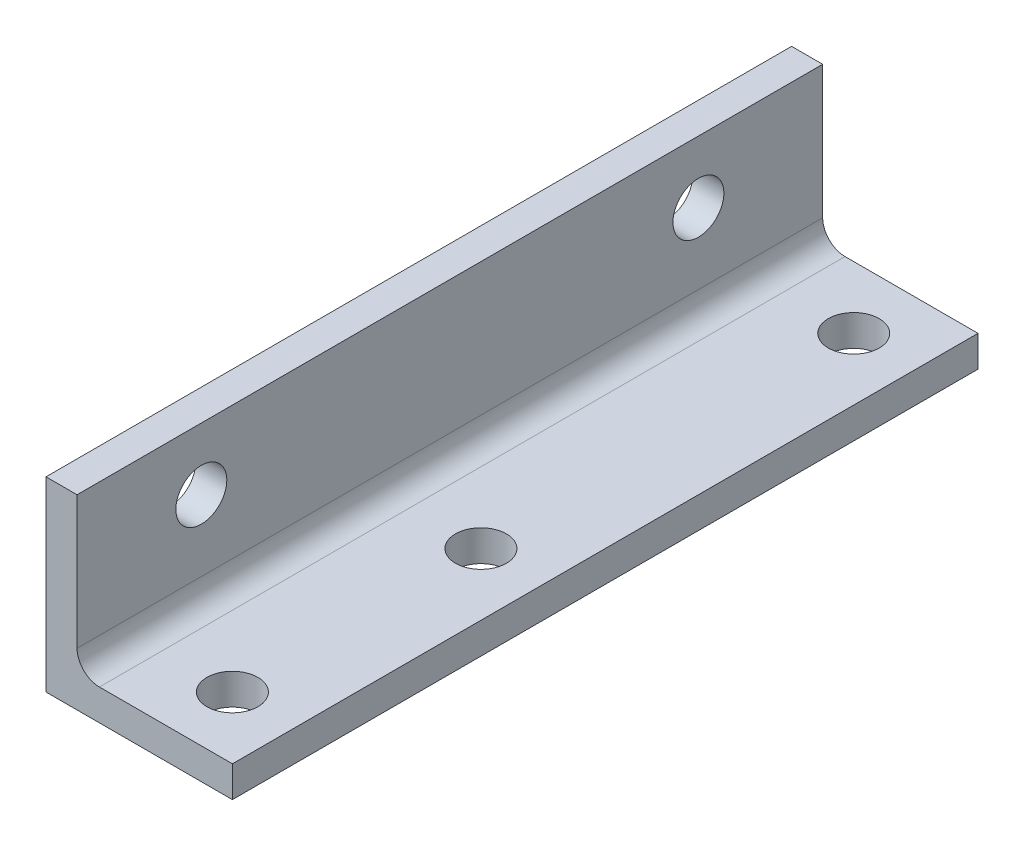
ISO-10303-21;
HEADER;
FILE_DESCRIPTION(('STEP AP214'),'2;1');
FILE_NAME('part.step','',(''),(''),'','','');
FILE_SCHEMA(('AUTOMOTIVE_DESIGN { 1 0 10303 214 1 1 1 1 }'));
ENDSEC;
DATA;
#1=APPLICATION_CONTEXT('core data for automotive mechanical design processes');
#2=APPLICATION_PROTOCOL_DEFINITION('international standard','automotive_design',2000,#1);
#3=PRODUCT_CONTEXT('',#1,'mechanical');
#4=PRODUCT('Part','Part','',(#3));
#5=PRODUCT_RELATED_PRODUCT_CATEGORY('part','',(#4));
#6=PRODUCT_DEFINITION_FORMATION('','',#4);
#7=PRODUCT_DEFINITION_CONTEXT('part definition',#1,'design');
#8=PRODUCT_DEFINITION('design','',#6,#7);
#9=PRODUCT_DEFINITION_SHAPE('','',#8);
#10=(LENGTH_UNIT() NAMED_UNIT(*) SI_UNIT(.MILLI.,.METRE.));
#11=(NAMED_UNIT(*) PLANE_ANGLE_UNIT() SI_UNIT($,.RADIAN.));
#12=(NAMED_UNIT(*) SI_UNIT($,.STERADIAN.) SOLID_ANGLE_UNIT());
#13=UNCERTAINTY_MEASURE_WITH_UNIT(LENGTH_MEASURE(1.E-05),#10,'distance_accuracy_value','');
#14=(GEOMETRIC_REPRESENTATION_CONTEXT(3) GLOBAL_UNCERTAINTY_ASSIGNED_CONTEXT((#13)) GLOBAL_UNIT_ASSIGNED_CONTEXT((#10,
#11,#12)) REPRESENTATION_CONTEXT('',''));
#15=CARTESIAN_POINT('',(0.,0.,0.));
#16=DIRECTION('',(0.,0.,1.));
#17=DIRECTION('',(1.,0.,0.));
#18=AXIS2_PLACEMENT_3D('',#15,#16,#17);
#19=CARTESIAN_POINT('',(0.,0.,152.4));
#20=DIRECTION('',(0.,1.,0.));
#21=DIRECTION('',(0.,0.,1.));
#22=AXIS2_PLACEMENT_3D('',#19,#20,#21);
#23=PLANE('',#22);
#24=CARTESIAN_POINT('',(25.4,0.,12.7));
#25=DIRECTION('',(0.,-1.,0.));
#26=DIRECTION('',(0.,0.,-1.));
#27=AXIS2_PLACEMENT_3D('',#24,#25,#26);
#28=CIRCLE('',#27,5.207);
#29=CARTESIAN_POINT('',(25.4,0.,7.493));
#30=VERTEX_POINT('',#29);
#31=EDGE_CURVE('E158',#30,#30,#28,.T.);
#32=ORIENTED_EDGE('',*,*,#31,.F.);
#33=EDGE_LOOP('',(#32));
#34=FACE_BOUND('',#33,.T.);
#35=CARTESIAN_POINT('',(25.4,0.,139.7));
#36=DIRECTION('',(0.,-1.,0.));
#37=DIRECTION('',(0.,0.,-1.));
#38=AXIS2_PLACEMENT_3D('',#35,#36,#37);
#39=CIRCLE('',#38,5.207);
#40=CARTESIAN_POINT('',(25.4,0.,134.493));
#41=VERTEX_POINT('',#40);
#42=EDGE_CURVE('E149',#41,#41,#39,.T.);
#43=ORIENTED_EDGE('',*,*,#42,.F.);
#44=EDGE_LOOP('',(#43));
#45=FACE_BOUND('',#44,.T.);
#46=CARTESIAN_POINT('',(25.4,0.,88.9));
#47=DIRECTION('',(0.,-1.,0.));
#48=DIRECTION('',(0.,0.,-1.));
#49=AXIS2_PLACEMENT_3D('',#46,#47,#48);
#50=CIRCLE('',#49,5.207);
#51=CARTESIAN_POINT('',(25.4,0.,83.693));
#52=VERTEX_POINT('',#51);
#53=EDGE_CURVE('E146',#52,#52,#50,.T.);
#54=ORIENTED_EDGE('',*,*,#53,.F.);
#55=EDGE_LOOP('',(#54));
#56=FACE_BOUND('',#55,.T.);
#57=DIRECTION('',(1.,0.,0.));
#58=VECTOR('',#57,1.);
#59=CARTESIAN_POINT('',(0.,0.,0.));
#60=LINE('',#59,#58);
#61=CARTESIAN_POINT('',(0.,0.,0.));
#62=VERTEX_POINT('',#61);
#63=CARTESIAN_POINT('',(38.1,0.,0.));
#64=VERTEX_POINT('',#63);
#65=EDGE_CURVE('E102',#62,#64,#60,.T.);
#66=ORIENTED_EDGE('',*,*,#65,.T.);
#67=DIRECTION('',(0.,0.,-1.));
#68=VECTOR('',#67,1.);
#69=CARTESIAN_POINT('',(38.1,0.,152.4));
#70=LINE('',#69,#68);
#71=CARTESIAN_POINT('',(38.1,0.,152.4));
#72=VERTEX_POINT('',#71);
#73=EDGE_CURVE('E87',#72,#64,#70,.T.);
#74=ORIENTED_EDGE('',*,*,#73,.F.);
#75=DIRECTION('',(1.,0.,0.));
#76=VECTOR('',#75,1.);
#77=CARTESIAN_POINT('',(0.,0.,152.4));
#78=LINE('',#77,#76);
#79=CARTESIAN_POINT('',(0.,0.,152.4));
#80=VERTEX_POINT('',#79);
#81=EDGE_CURVE('E122',#80,#72,#78,.T.);
#82=ORIENTED_EDGE('',*,*,#81,.F.);
#83=DIRECTION('',(0.,0.,-1.));
#84=VECTOR('',#83,1.);
#85=CARTESIAN_POINT('',(0.,0.,152.4));
#86=LINE('',#85,#84);
#87=EDGE_CURVE('E104',#80,#62,#86,.T.);
#88=ORIENTED_EDGE('',*,*,#87,.T.);
#89=EDGE_LOOP('',(#66,#74,#82,#88));
#90=FACE_BOUND('',#89,.T.);
#91=ADVANCED_FACE('F28',(#34,#45,#56,#90),#23,.F.);
#92=CARTESIAN_POINT('',(38.1,6.35,152.4));
#93=DIRECTION('',(1.,0.,0.));
#94=DIRECTION('',(0.,0.,-1.));
#95=AXIS2_PLACEMENT_3D('',#92,#93,#94);
#96=PLANE('',#95);
#97=DIRECTION('',(0.,-1.,0.));
#98=VECTOR('',#97,1.);
#99=CARTESIAN_POINT('',(38.1,6.35,0.));
#100=LINE('',#99,#98);
#101=CARTESIAN_POINT('',(38.1,6.35,0.));
#102=VERTEX_POINT('',#101);
#103=EDGE_CURVE('E92',#102,#64,#100,.T.);
#104=ORIENTED_EDGE('',*,*,#103,.F.);
#105=DIRECTION('',(0.,0.,-1.));
#106=VECTOR('',#105,1.);
#107=CARTESIAN_POINT('',(38.1,6.35,152.4));
#108=LINE('',#107,#106);
#109=CARTESIAN_POINT('',(38.1,6.35,152.4));
#110=VERTEX_POINT('',#109);
#111=EDGE_CURVE('E98',#110,#102,#108,.T.);
#112=ORIENTED_EDGE('',*,*,#111,.F.);
#113=DIRECTION('',(0.,-1.,0.));
#114=VECTOR('',#113,1.);
#115=CARTESIAN_POINT('',(38.1,6.35,152.4));
#116=LINE('',#115,#114);
#117=EDGE_CURVE('E94',#110,#72,#116,.T.);
#118=ORIENTED_EDGE('',*,*,#117,.T.);
#119=ORIENTED_EDGE('',*,*,#73,.T.);
#120=EDGE_LOOP('',(#104,#112,#118,#119));
#121=FACE_BOUND('',#120,.T.);
#122=ADVANCED_FACE('F89',(#121),#96,.T.);
#123=CARTESIAN_POINT('',(0.,6.35,152.4));
#124=DIRECTION('',(0.,1.,0.));
#125=DIRECTION('',(0.,0.,1.));
#126=AXIS2_PLACEMENT_3D('',#123,#124,#125);
#127=PLANE('',#126);
#128=CARTESIAN_POINT('',(25.4,6.35000000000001,12.7));
#129=DIRECTION('',(0.,1.,0.));
#130=DIRECTION('',(0.,0.,1.));
#131=AXIS2_PLACEMENT_3D('',#128,#129,#130);
#132=CIRCLE('',#131,5.207);
#133=CARTESIAN_POINT('',(25.4,6.35000000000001,7.493));
#134=VERTEX_POINT('',#133);
#135=EDGE_CURVE('E31',#134,#134,#132,.T.);
#136=ORIENTED_EDGE('',*,*,#135,.F.);
#137=EDGE_LOOP('',(#136));
#138=FACE_BOUND('',#137,.T.);
#139=CARTESIAN_POINT('',(25.4,6.35000000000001,139.7));
#140=DIRECTION('',(0.,1.,0.));
#141=DIRECTION('',(0.,0.,1.));
#142=AXIS2_PLACEMENT_3D('',#139,#140,#141);
#143=CIRCLE('',#142,5.207);
#144=CARTESIAN_POINT('',(25.4,6.35000000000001,134.493));
#145=VERTEX_POINT('',#144);
#146=EDGE_CURVE('E147',#145,#145,#143,.T.);
#147=ORIENTED_EDGE('',*,*,#146,.F.);
#148=EDGE_LOOP('',(#147));
#149=FACE_BOUND('',#148,.T.);
#150=CARTESIAN_POINT('',(25.4,6.35000000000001,88.9));
#151=DIRECTION('',(0.,1.,0.));
#152=DIRECTION('',(0.,0.,1.));
#153=AXIS2_PLACEMENT_3D('',#150,#151,#152);
#154=CIRCLE('',#153,5.207);
#155=CARTESIAN_POINT('',(25.4,6.35000000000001,83.693));
#156=VERTEX_POINT('',#155);
#157=EDGE_CURVE('E106',#156,#156,#154,.T.);
#158=ORIENTED_EDGE('',*,*,#157,.F.);
#159=EDGE_LOOP('',(#158));
#160=FACE_BOUND('',#159,.T.);
#161=DIRECTION('',(1.,0.,0.));
#162=VECTOR('',#161,1.);
#163=CARTESIAN_POINT('',(0.,6.35,0.));
#164=LINE('',#163,#162);
#165=CARTESIAN_POINT('',(10.922,6.35,0.));
#166=VERTEX_POINT('',#165);
#167=EDGE_CURVE('E109',#166,#102,#164,.T.);
#168=ORIENTED_EDGE('',*,*,#167,.F.);
#169=DIRECTION('',(0.,0.,-1.));
#170=VECTOR('',#169,1.);
#171=CARTESIAN_POINT('',(10.922,6.35,152.4));
#172=LINE('',#171,#170);
#173=CARTESIAN_POINT('',(10.922,6.35,152.4));
#174=VERTEX_POINT('',#173);
#175=EDGE_CURVE('E44',#166,#174,#172,.F.);
#176=ORIENTED_EDGE('',*,*,#175,.T.);
#177=DIRECTION('',(1.,0.,0.));
#178=VECTOR('',#177,1.);
#179=CARTESIAN_POINT('',(0.,6.35,152.4));
#180=LINE('',#179,#178);
#181=EDGE_CURVE('E125',#174,#110,#180,.T.);
#182=ORIENTED_EDGE('',*,*,#181,.T.);
#183=ORIENTED_EDGE('',*,*,#111,.T.);
#184=EDGE_LOOP('',(#168,#176,#182,#183));
#185=FACE_BOUND('',#184,.T.);
#186=ADVANCED_FACE('F198',(#138,#149,#160,#185),#127,.T.);
#187=CARTESIAN_POINT('',(6.35,38.1,152.4));
#188=DIRECTION('',(1.,0.,0.));
#189=DIRECTION('',(0.,1.,0.));
#190=AXIS2_PLACEMENT_3D('',#187,#188,#189);
#191=PLANE('',#190);
#192=CARTESIAN_POINT('',(6.35000000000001,25.4,25.4));
#193=DIRECTION('',(1.,0.,0.));
#194=DIRECTION('',(0.,1.,0.));
#195=AXIS2_PLACEMENT_3D('',#192,#193,#194);
#196=CIRCLE('',#195,5.207);
#197=CARTESIAN_POINT('',(6.35000000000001,20.193,25.4));
#198=VERTEX_POINT('',#197);
#199=EDGE_CURVE('E168',#198,#198,#196,.T.);
#200=ORIENTED_EDGE('',*,*,#199,.F.);
#201=EDGE_LOOP('',(#200));
#202=FACE_BOUND('',#201,.T.);
#203=CARTESIAN_POINT('',(6.35000000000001,25.4,127.));
#204=DIRECTION('',(1.,0.,0.));
#205=DIRECTION('',(0.,1.,0.));
#206=AXIS2_PLACEMENT_3D('',#203,#204,#205);
#207=CIRCLE('',#206,5.20699999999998);
#208=CARTESIAN_POINT('',(6.35000000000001,20.193,127.));
#209=VERTEX_POINT('',#208);
#210=EDGE_CURVE('E162',#209,#209,#207,.T.);
#211=ORIENTED_EDGE('',*,*,#210,.F.);
#212=EDGE_LOOP('',(#211));
#213=FACE_BOUND('',#212,.T.);
#214=DIRECTION('',(0.,-1.,0.));
#215=VECTOR('',#214,1.);
#216=CARTESIAN_POINT('',(6.35,38.1,152.4));
#217=LINE('',#216,#215);
#218=CARTESIAN_POINT('',(6.35,38.1,152.4));
#219=VERTEX_POINT('',#218);
#220=CARTESIAN_POINT('',(6.35,10.922,152.4));
#221=VERTEX_POINT('',#220);
#222=EDGE_CURVE('E127',#219,#221,#217,.T.);
#223=ORIENTED_EDGE('',*,*,#222,.T.);
#224=DIRECTION('',(0.,0.,-1.));
#225=VECTOR('',#224,1.);
#226=CARTESIAN_POINT('',(6.35,10.922,0.));
#227=LINE('',#226,#225);
#228=CARTESIAN_POINT('',(6.35,10.922,0.));
#229=VERTEX_POINT('',#228);
#230=EDGE_CURVE('E97',#221,#229,#227,.T.);
#231=ORIENTED_EDGE('',*,*,#230,.T.);
#232=DIRECTION('',(0.,-1.,0.));
#233=VECTOR('',#232,1.);
#234=CARTESIAN_POINT('',(6.35,38.1,0.));
#235=LINE('',#234,#233);
#236=CARTESIAN_POINT('',(6.35,38.1,0.));
#237=VERTEX_POINT('',#236);
#238=EDGE_CURVE('E112',#237,#229,#235,.T.);
#239=ORIENTED_EDGE('',*,*,#238,.F.);
#240=DIRECTION('',(0.,0.,-1.));
#241=VECTOR('',#240,1.);
#242=CARTESIAN_POINT('',(6.35,38.1,152.4));
#243=LINE('',#242,#241);
#244=EDGE_CURVE('E138',#219,#237,#243,.T.);
#245=ORIENTED_EDGE('',*,*,#244,.F.);
#246=EDGE_LOOP('',(#223,#231,#239,#245));
#247=FACE_BOUND('',#246,.T.);
#248=ADVANCED_FACE('F192',(#202,#213,#247),#191,.T.);
#249=CARTESIAN_POINT('',(0.,38.1,152.4));
#250=DIRECTION('',(0.,1.,0.));
#251=DIRECTION('',(0.,0.,1.));
#252=AXIS2_PLACEMENT_3D('',#249,#250,#251);
#253=PLANE('',#252);
#254=DIRECTION('',(1.,0.,0.));
#255=VECTOR('',#254,1.);
#256=CARTESIAN_POINT('',(0.,38.1,0.));
#257=LINE('',#256,#255);
#258=CARTESIAN_POINT('',(0.,38.1,0.));
#259=VERTEX_POINT('',#258);
#260=EDGE_CURVE('E117',#259,#237,#257,.T.);
#261=ORIENTED_EDGE('',*,*,#260,.F.);
#262=DIRECTION('',(0.,0.,-1.));
#263=VECTOR('',#262,1.);
#264=CARTESIAN_POINT('',(0.,38.1,152.4));
#265=LINE('',#264,#263);
#266=CARTESIAN_POINT('',(0.,38.1,152.4));
#267=VERTEX_POINT('',#266);
#268=EDGE_CURVE('E136',#267,#259,#265,.T.);
#269=ORIENTED_EDGE('',*,*,#268,.F.);
#270=DIRECTION('',(1.,0.,0.));
#271=VECTOR('',#270,1.);
#272=CARTESIAN_POINT('',(0.,38.1,152.4));
#273=LINE('',#272,#271);
#274=EDGE_CURVE('E130',#267,#219,#273,.T.);
#275=ORIENTED_EDGE('',*,*,#274,.T.);
#276=ORIENTED_EDGE('',*,*,#244,.T.);
#277=EDGE_LOOP('',(#261,#269,#275,#276));
#278=FACE_BOUND('',#277,.T.);
#279=ADVANCED_FACE('F181',(#278),#253,.T.);
#280=CARTESIAN_POINT('',(0.,38.1,152.4));
#281=DIRECTION('',(1.,0.,0.));
#282=DIRECTION('',(0.,1.,0.));
#283=AXIS2_PLACEMENT_3D('',#280,#281,#282);
#284=PLANE('',#283);
#285=CARTESIAN_POINT('',(0.,25.4,25.4));
#286=DIRECTION('',(-1.,0.,0.));
#287=DIRECTION('',(0.,-1.,0.));
#288=AXIS2_PLACEMENT_3D('',#285,#286,#287);
#289=CIRCLE('',#288,5.207);
#290=CARTESIAN_POINT('',(0.,20.193,25.4));
#291=VERTEX_POINT('',#290);
#292=EDGE_CURVE('E171',#291,#291,#289,.T.);
#293=ORIENTED_EDGE('',*,*,#292,.F.);
#294=EDGE_LOOP('',(#293));
#295=FACE_BOUND('',#294,.T.);
#296=CARTESIAN_POINT('',(0.,25.4,127.));
#297=DIRECTION('',(-1.,0.,0.));
#298=DIRECTION('',(0.,-1.,0.));
#299=AXIS2_PLACEMENT_3D('',#296,#297,#298);
#300=CIRCLE('',#299,5.20699999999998);
#301=CARTESIAN_POINT('',(0.,20.193,127.));
#302=VERTEX_POINT('',#301);
#303=EDGE_CURVE('E165',#302,#302,#300,.T.);
#304=ORIENTED_EDGE('',*,*,#303,.F.);
#305=EDGE_LOOP('',(#304));
#306=FACE_BOUND('',#305,.T.);
#307=DIRECTION('',(0.,-1.,0.));
#308=VECTOR('',#307,1.);
#309=CARTESIAN_POINT('',(0.,38.1,0.));
#310=LINE('',#309,#308);
#311=EDGE_CURVE('E120',#259,#62,#310,.T.);
#312=ORIENTED_EDGE('',*,*,#311,.T.);
#313=ORIENTED_EDGE('',*,*,#87,.F.);
#314=DIRECTION('',(0.,-1.,0.));
#315=VECTOR('',#314,1.);
#316=CARTESIAN_POINT('',(0.,38.1,152.4));
#317=LINE('',#316,#315);
#318=EDGE_CURVE('E133',#267,#80,#317,.T.);
#319=ORIENTED_EDGE('',*,*,#318,.F.);
#320=ORIENTED_EDGE('',*,*,#268,.T.);
#321=EDGE_LOOP('',(#312,#313,#319,#320));
#322=FACE_BOUND('',#321,.T.);
#323=ADVANCED_FACE('F177',(#295,#306,#322),#284,.F.);
#324=CARTESIAN_POINT('',(38.1,0.,152.4));
#325=DIRECTION('',(0.,0.,-1.));
#326=DIRECTION('',(-1.,0.,0.));
#327=AXIS2_PLACEMENT_3D('',#324,#325,#326);
#328=PLANE('',#327);
#329=ORIENTED_EDGE('',*,*,#81,.T.);
#330=ORIENTED_EDGE('',*,*,#117,.F.);
#331=ORIENTED_EDGE('',*,*,#181,.F.);
#332=CARTESIAN_POINT('',(10.922,10.922,152.4));
#333=DIRECTION('',(0.,0.,-1.));
#334=DIRECTION('',(-1.,0.,0.));
#335=AXIS2_PLACEMENT_3D('',#332,#333,#334);
#336=CIRCLE('',#335,4.572);
#337=EDGE_CURVE('E11',#174,#221,#336,.T.);
#338=ORIENTED_EDGE('',*,*,#337,.T.);
#339=ORIENTED_EDGE('',*,*,#222,.F.);
#340=ORIENTED_EDGE('',*,*,#274,.F.);
#341=ORIENTED_EDGE('',*,*,#318,.T.);
#342=EDGE_LOOP('',(#329,#330,#331,#338,#339,#340,#341));
#343=FACE_BOUND('',#342,.T.);
#344=ADVANCED_FACE('F180',(#343),#328,.F.);
#345=CARTESIAN_POINT('',(38.1,0.,0.));
#346=DIRECTION('',(0.,0.,-1.));
#347=DIRECTION('',(-1.,0.,0.));
#348=AXIS2_PLACEMENT_3D('',#345,#346,#347);
#349=PLANE('',#348);
#350=ORIENTED_EDGE('',*,*,#65,.F.);
#351=ORIENTED_EDGE('',*,*,#311,.F.);
#352=ORIENTED_EDGE('',*,*,#260,.T.);
#353=ORIENTED_EDGE('',*,*,#238,.T.);
#354=CARTESIAN_POINT('',(10.922,10.922,0.));
#355=DIRECTION('',(0.,0.,-1.));
#356=DIRECTION('',(-1.,0.,0.));
#357=AXIS2_PLACEMENT_3D('',#354,#355,#356);
#358=CIRCLE('',#357,4.572);
#359=EDGE_CURVE('E36',#229,#166,#358,.F.);
#360=ORIENTED_EDGE('',*,*,#359,.T.);
#361=ORIENTED_EDGE('',*,*,#167,.T.);
#362=ORIENTED_EDGE('',*,*,#103,.T.);
#363=EDGE_LOOP('',(#350,#351,#352,#353,#360,#361,#362));
#364=FACE_BOUND('',#363,.T.);
#365=ADVANCED_FACE('F108',(#364),#349,.T.);
#366=CARTESIAN_POINT('',(10.922,10.922,152.4));
#367=DIRECTION('',(0.,0.,1.));
#368=DIRECTION('',(1.,0.,0.));
#369=AXIS2_PLACEMENT_3D('',#366,#367,#368);
#370=CYLINDRICAL_SURFACE('',#369,4.572);
#371=ORIENTED_EDGE('',*,*,#337,.F.);
#372=ORIENTED_EDGE('',*,*,#175,.F.);
#373=ORIENTED_EDGE('',*,*,#359,.F.);
#374=ORIENTED_EDGE('',*,*,#230,.F.);
#375=EDGE_LOOP('',(#371,#372,#373,#374));
#376=FACE_BOUND('',#375,.T.);
#377=ADVANCED_FACE('F196',(#376),#370,.F.);
#378=CARTESIAN_POINT('',(25.4,38.1,88.9));
#379=DIRECTION('',(0.,-1.,0.));
#380=DIRECTION('',(0.,0.,-1.));
#381=AXIS2_PLACEMENT_3D('',#378,#379,#380);
#382=CYLINDRICAL_SURFACE('',#381,5.207);
#383=CARTESIAN_POINT('',(25.4,6.35000000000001,83.693));
#384=CARTESIAN_POINT('',(25.4,6.28385416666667,83.693));
#385=CARTESIAN_POINT('',(25.4,6.21770833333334,83.693));
#386=CARTESIAN_POINT('',(25.4,6.08541666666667,83.693));
#387=CARTESIAN_POINT('',(25.4,6.01927083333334,83.693));
#388=CARTESIAN_POINT('',(25.4,5.88697916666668,83.693));
#389=CARTESIAN_POINT('',(25.4,5.82083333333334,83.693));
#390=CARTESIAN_POINT('',(25.4,5.68854166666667,83.693));
#391=CARTESIAN_POINT('',(25.4,5.62239583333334,83.693));
#392=CARTESIAN_POINT('',(25.4,5.49010416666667,83.693));
#393=CARTESIAN_POINT('',(25.4,5.42395833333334,83.693));
#394=CARTESIAN_POINT('',(25.4,5.29166666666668,83.693));
#395=CARTESIAN_POINT('',(25.4,5.22552083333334,83.693));
#396=CARTESIAN_POINT('',(25.4,5.09322916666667,83.693));
#397=CARTESIAN_POINT('',(25.4,5.02708333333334,83.693));
#398=CARTESIAN_POINT('',(25.4,4.89479166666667,83.693));
#399=CARTESIAN_POINT('',(25.4,4.82864583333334,83.693));
#400=CARTESIAN_POINT('',(25.4,4.69635416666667,83.693));
#401=CARTESIAN_POINT('',(25.4,4.63020833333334,83.693));
#402=CARTESIAN_POINT('',(25.4,4.49791666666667,83.693));
#403=CARTESIAN_POINT('',(25.4,4.43177083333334,83.693));
#404=CARTESIAN_POINT('',(25.4,4.29947916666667,83.693));
#405=CARTESIAN_POINT('',(25.4,4.23333333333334,83.693));
#406=CARTESIAN_POINT('',(25.4,4.10104166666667,83.693));
#407=CARTESIAN_POINT('',(25.4,4.03489583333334,83.693));
#408=CARTESIAN_POINT('',(25.4,3.90260416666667,83.693));
#409=CARTESIAN_POINT('',(25.4,3.83645833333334,83.693));
#410=CARTESIAN_POINT('',(25.4,3.70416666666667,83.693));
#411=CARTESIAN_POINT('',(25.4,3.63802083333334,83.693));
#412=CARTESIAN_POINT('',(25.4,3.50572916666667,83.693));
#413=CARTESIAN_POINT('',(25.4,3.43958333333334,83.693));
#414=CARTESIAN_POINT('',(25.4,3.30729166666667,83.693));
#415=CARTESIAN_POINT('',(25.4,3.24114583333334,83.693));
#416=CARTESIAN_POINT('',(25.4,3.10885416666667,83.693));
#417=CARTESIAN_POINT('',(25.4,3.04270833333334,83.693));
#418=CARTESIAN_POINT('',(25.4,2.91041666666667,83.693));
#419=CARTESIAN_POINT('',(25.4,2.84427083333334,83.693));
#420=CARTESIAN_POINT('',(25.4,2.71197916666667,83.693));
#421=CARTESIAN_POINT('',(25.4,2.64583333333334,83.693));
#422=CARTESIAN_POINT('',(25.4,2.51354166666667,83.693));
#423=CARTESIAN_POINT('',(25.4,2.44739583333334,83.693));
#424=CARTESIAN_POINT('',(25.4,2.31510416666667,83.693));
#425=CARTESIAN_POINT('',(25.4,2.24895833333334,83.693));
#426=CARTESIAN_POINT('',(25.4,2.11666666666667,83.693));
#427=CARTESIAN_POINT('',(25.4,2.05052083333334,83.693));
#428=CARTESIAN_POINT('',(25.4,1.91822916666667,83.693));
#429=CARTESIAN_POINT('',(25.4,1.85208333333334,83.693));
#430=CARTESIAN_POINT('',(25.4,1.71979166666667,83.693));
#431=CARTESIAN_POINT('',(25.4,1.65364583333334,83.693));
#432=CARTESIAN_POINT('',(25.4,1.52135416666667,83.693));
#433=CARTESIAN_POINT('',(25.4,1.45520833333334,83.693));
#434=CARTESIAN_POINT('',(25.4,1.32291666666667,83.693));
#435=CARTESIAN_POINT('',(25.4,1.25677083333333,83.693));
#436=CARTESIAN_POINT('',(25.4,1.12447916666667,83.693));
#437=CARTESIAN_POINT('',(25.4,1.05833333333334,83.693));
#438=CARTESIAN_POINT('',(25.4,0.926041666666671,83.693));
#439=CARTESIAN_POINT('',(25.4,0.859895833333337,83.693));
#440=CARTESIAN_POINT('',(25.4,0.727604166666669,83.693));
#441=CARTESIAN_POINT('',(25.4,0.661458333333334,83.693));
#442=CARTESIAN_POINT('',(25.4,0.529166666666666,83.693));
#443=CARTESIAN_POINT('',(25.4,0.463020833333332,83.693));
#444=CARTESIAN_POINT('',(25.4,0.330729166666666,83.693));
#445=CARTESIAN_POINT('',(25.4,0.264583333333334,83.693));
#446=CARTESIAN_POINT('',(25.4,0.132291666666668,83.693));
#447=CARTESIAN_POINT('',(25.4,0.0661458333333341,83.693));
#448=CARTESIAN_POINT('',(25.4,0.,83.693));
#449=B_SPLINE_CURVE_WITH_KNOTS('',3,(#383,#384,#385,#386,#387,#388,#389,#390,#391,#392,#393,
#394,#395,#396,#397,#398,#399,#400,#401,#402,#403,#404,#405,#406,#407,#408,#409,#410,#411,#412,
#413,#414,#415,#416,#417,#418,#419,#420,#421,#422,#423,#424,#425,#426,#427,#428,#429,#430,#431,
#432,#433,#434,#435,#436,#437,#438,#439,#440,#441,#442,#443,#444,#445,#446,#447,#448),
.UNSPECIFIED.,.F.,.F.,(4,2,2,2,2,2,2,2,2,2,2,2,2,2,2,2,2,2,2,2,2,2,2,2,2,2,2,2,2,2,2,2,4),(0.,
0.198437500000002,0.396874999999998,0.5953125,0.793750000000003,0.992187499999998,1.190625,
1.3890625,1.58750000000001,1.7859375,1.984375,2.18281250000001,2.38125,2.5796875,
2.77812500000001,2.9765625,3.175,3.37343750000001,3.571875,3.7703125,3.96875000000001,4.1671875,
4.365625,4.56406250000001,4.7625,4.96093750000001,5.15937500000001,5.3578125,5.55625000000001,
5.75468750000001,5.95312500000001,6.15156250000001,6.35000000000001),.UNSPECIFIED.);
#450=EDGE_CURVE('BSEAM221',#156,#52,#449,.T.);
#451=ORIENTED_EDGE('',*,*,#157,.T.);
#452=ORIENTED_EDGE('',*,*,#53,.T.);
#453=ORIENTED_EDGE('',*,*,#450,.T.);
#454=ORIENTED_EDGE('',*,*,#450,.F.);
#455=EDGE_LOOP('',(#451,#453,#452,#454));
#456=FACE_BOUND('',#455,.T.);
#457=ADVANCED_FACE('F221',(#456),#382,.F.);
#458=CARTESIAN_POINT('',(25.4,38.1,139.7));
#459=DIRECTION('',(0.,-1.,0.));
#460=DIRECTION('',(0.,0.,-1.));
#461=AXIS2_PLACEMENT_3D('',#458,#459,#460);
#462=CYLINDRICAL_SURFACE('',#461,5.207);
#463=CARTESIAN_POINT('',(25.4,6.35000000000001,134.493));
#464=CARTESIAN_POINT('',(25.4,6.28385416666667,134.493));
#465=CARTESIAN_POINT('',(25.4,6.21770833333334,134.493));
#466=CARTESIAN_POINT('',(25.4,6.08541666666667,134.493));
#467=CARTESIAN_POINT('',(25.4,6.01927083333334,134.493));
#468=CARTESIAN_POINT('',(25.4,5.88697916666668,134.493));
#469=CARTESIAN_POINT('',(25.4,5.82083333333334,134.493));
#470=CARTESIAN_POINT('',(25.4,5.68854166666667,134.493));
#471=CARTESIAN_POINT('',(25.4,5.62239583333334,134.493));
#472=CARTESIAN_POINT('',(25.4,5.49010416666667,134.493));
#473=CARTESIAN_POINT('',(25.4,5.42395833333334,134.493));
#474=CARTESIAN_POINT('',(25.4,5.29166666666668,134.493));
#475=CARTESIAN_POINT('',(25.4,5.22552083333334,134.493));
#476=CARTESIAN_POINT('',(25.4,5.09322916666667,134.493));
#477=CARTESIAN_POINT('',(25.4,5.02708333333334,134.493));
#478=CARTESIAN_POINT('',(25.4,4.89479166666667,134.493));
#479=CARTESIAN_POINT('',(25.4,4.82864583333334,134.493));
#480=CARTESIAN_POINT('',(25.4,4.69635416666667,134.493));
#481=CARTESIAN_POINT('',(25.4,4.63020833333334,134.493));
#482=CARTESIAN_POINT('',(25.4,4.49791666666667,134.493));
#483=CARTESIAN_POINT('',(25.4,4.43177083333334,134.493));
#484=CARTESIAN_POINT('',(25.4,4.29947916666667,134.493));
#485=CARTESIAN_POINT('',(25.4,4.23333333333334,134.493));
#486=CARTESIAN_POINT('',(25.4,4.10104166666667,134.493));
#487=CARTESIAN_POINT('',(25.4,4.03489583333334,134.493));
#488=CARTESIAN_POINT('',(25.4,3.90260416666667,134.493));
#489=CARTESIAN_POINT('',(25.4,3.83645833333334,134.493));
#490=CARTESIAN_POINT('',(25.4,3.70416666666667,134.493));
#491=CARTESIAN_POINT('',(25.4,3.63802083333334,134.493));
#492=CARTESIAN_POINT('',(25.4,3.50572916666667,134.493));
#493=CARTESIAN_POINT('',(25.4,3.43958333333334,134.493));
#494=CARTESIAN_POINT('',(25.4,3.30729166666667,134.493));
#495=CARTESIAN_POINT('',(25.4,3.24114583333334,134.493));
#496=CARTESIAN_POINT('',(25.4,3.10885416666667,134.493));
#497=CARTESIAN_POINT('',(25.4,3.04270833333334,134.493));
#498=CARTESIAN_POINT('',(25.4,2.91041666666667,134.493));
#499=CARTESIAN_POINT('',(25.4,2.84427083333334,134.493));
#500=CARTESIAN_POINT('',(25.4,2.71197916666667,134.493));
#501=CARTESIAN_POINT('',(25.4,2.64583333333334,134.493));
#502=CARTESIAN_POINT('',(25.4,2.51354166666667,134.493));
#503=CARTESIAN_POINT('',(25.4,2.44739583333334,134.493));
#504=CARTESIAN_POINT('',(25.4,2.31510416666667,134.493));
#505=CARTESIAN_POINT('',(25.4,2.24895833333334,134.493));
#506=CARTESIAN_POINT('',(25.4,2.11666666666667,134.493));
#507=CARTESIAN_POINT('',(25.4,2.05052083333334,134.493));
#508=CARTESIAN_POINT('',(25.4,1.91822916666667,134.493));
#509=CARTESIAN_POINT('',(25.4,1.85208333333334,134.493));
#510=CARTESIAN_POINT('',(25.4,1.71979166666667,134.493));
#511=CARTESIAN_POINT('',(25.4,1.65364583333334,134.493));
#512=CARTESIAN_POINT('',(25.4,1.52135416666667,134.493));
#513=CARTESIAN_POINT('',(25.4,1.45520833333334,134.493));
#514=CARTESIAN_POINT('',(25.4,1.32291666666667,134.493));
#515=CARTESIAN_POINT('',(25.4,1.25677083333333,134.493));
#516=CARTESIAN_POINT('',(25.4,1.12447916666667,134.493));
#517=CARTESIAN_POINT('',(25.4,1.05833333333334,134.493));
#518=CARTESIAN_POINT('',(25.4,0.926041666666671,134.493));
#519=CARTESIAN_POINT('',(25.4,0.859895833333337,134.493));
#520=CARTESIAN_POINT('',(25.4,0.727604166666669,134.493));
#521=CARTESIAN_POINT('',(25.4,0.661458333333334,134.493));
#522=CARTESIAN_POINT('',(25.4,0.529166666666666,134.493));
#523=CARTESIAN_POINT('',(25.4,0.463020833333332,134.493));
#524=CARTESIAN_POINT('',(25.4,0.330729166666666,134.493));
#525=CARTESIAN_POINT('',(25.4,0.264583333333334,134.493));
#526=CARTESIAN_POINT('',(25.4,0.132291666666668,134.493));
#527=CARTESIAN_POINT('',(25.4,0.0661458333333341,134.493));
#528=CARTESIAN_POINT('',(25.4,0.,134.493));
#529=B_SPLINE_CURVE_WITH_KNOTS('',3,(#463,#464,#465,#466,#467,#468,#469,#470,#471,#472,#473,
#474,#475,#476,#477,#478,#479,#480,#481,#482,#483,#484,#485,#486,#487,#488,#489,#490,#491,#492,
#493,#494,#495,#496,#497,#498,#499,#500,#501,#502,#503,#504,#505,#506,#507,#508,#509,#510,#511,
#512,#513,#514,#515,#516,#517,#518,#519,#520,#521,#522,#523,#524,#525,#526,#527,#528),
.UNSPECIFIED.,.F.,.F.,(4,2,2,2,2,2,2,2,2,2,2,2,2,2,2,2,2,2,2,2,2,2,2,2,2,2,2,2,2,2,2,2,4),(0.,
0.198437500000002,0.396874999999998,0.5953125,0.793750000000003,0.992187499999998,1.190625,
1.3890625,1.58750000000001,1.7859375,1.984375,2.18281250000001,2.38125,2.5796875,
2.77812500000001,2.9765625,3.175,3.37343750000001,3.571875,3.7703125,3.96875000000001,4.1671875,
4.365625,4.56406250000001,4.7625,4.96093750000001,5.15937500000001,5.3578125,5.55625000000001,
5.75468750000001,5.95312500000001,6.15156250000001,6.35000000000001),.UNSPECIFIED.);
#530=EDGE_CURVE('BSEAM222',#145,#41,#529,.T.);
#531=ORIENTED_EDGE('',*,*,#146,.T.);
#532=ORIENTED_EDGE('',*,*,#42,.T.);
#533=ORIENTED_EDGE('',*,*,#530,.T.);
#534=ORIENTED_EDGE('',*,*,#530,.F.);
#535=EDGE_LOOP('',(#531,#533,#532,#534));
#536=FACE_BOUND('',#535,.T.);
#537=ADVANCED_FACE('F222',(#536),#462,.F.);
#538=CARTESIAN_POINT('',(25.4,38.1,12.7));
#539=DIRECTION('',(0.,-1.,0.));
#540=DIRECTION('',(0.,0.,-1.));
#541=AXIS2_PLACEMENT_3D('',#538,#539,#540);
#542=CYLINDRICAL_SURFACE('',#541,5.207);
#543=CARTESIAN_POINT('',(25.4,6.35000000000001,7.493));
#544=CARTESIAN_POINT('',(25.4,6.28385416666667,7.493));
#545=CARTESIAN_POINT('',(25.4,6.21770833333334,7.493));
#546=CARTESIAN_POINT('',(25.4,6.08541666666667,7.493));
#547=CARTESIAN_POINT('',(25.4,6.01927083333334,7.493));
#548=CARTESIAN_POINT('',(25.4,5.88697916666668,7.493));
#549=CARTESIAN_POINT('',(25.4,5.82083333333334,7.493));
#550=CARTESIAN_POINT('',(25.4,5.68854166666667,7.493));
#551=CARTESIAN_POINT('',(25.4,5.62239583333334,7.493));
#552=CARTESIAN_POINT('',(25.4,5.49010416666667,7.493));
#553=CARTESIAN_POINT('',(25.4,5.42395833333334,7.493));
#554=CARTESIAN_POINT('',(25.4,5.29166666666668,7.493));
#555=CARTESIAN_POINT('',(25.4,5.22552083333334,7.493));
#556=CARTESIAN_POINT('',(25.4,5.09322916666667,7.493));
#557=CARTESIAN_POINT('',(25.4,5.02708333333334,7.493));
#558=CARTESIAN_POINT('',(25.4,4.89479166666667,7.493));
#559=CARTESIAN_POINT('',(25.4,4.82864583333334,7.493));
#560=CARTESIAN_POINT('',(25.4,4.69635416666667,7.493));
#561=CARTESIAN_POINT('',(25.4,4.63020833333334,7.493));
#562=CARTESIAN_POINT('',(25.4,4.49791666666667,7.493));
#563=CARTESIAN_POINT('',(25.4,4.43177083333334,7.493));
#564=CARTESIAN_POINT('',(25.4,4.29947916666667,7.493));
#565=CARTESIAN_POINT('',(25.4,4.23333333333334,7.493));
#566=CARTESIAN_POINT('',(25.4,4.10104166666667,7.493));
#567=CARTESIAN_POINT('',(25.4,4.03489583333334,7.493));
#568=CARTESIAN_POINT('',(25.4,3.90260416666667,7.493));
#569=CARTESIAN_POINT('',(25.4,3.83645833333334,7.493));
#570=CARTESIAN_POINT('',(25.4,3.70416666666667,7.493));
#571=CARTESIAN_POINT('',(25.4,3.63802083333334,7.493));
#572=CARTESIAN_POINT('',(25.4,3.50572916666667,7.493));
#573=CARTESIAN_POINT('',(25.4,3.43958333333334,7.493));
#574=CARTESIAN_POINT('',(25.4,3.30729166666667,7.493));
#575=CARTESIAN_POINT('',(25.4,3.24114583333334,7.493));
#576=CARTESIAN_POINT('',(25.4,3.10885416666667,7.493));
#577=CARTESIAN_POINT('',(25.4,3.04270833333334,7.493));
#578=CARTESIAN_POINT('',(25.4,2.91041666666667,7.493));
#579=CARTESIAN_POINT('',(25.4,2.84427083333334,7.493));
#580=CARTESIAN_POINT('',(25.4,2.71197916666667,7.493));
#581=CARTESIAN_POINT('',(25.4,2.64583333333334,7.493));
#582=CARTESIAN_POINT('',(25.4,2.51354166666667,7.493));
#583=CARTESIAN_POINT('',(25.4,2.44739583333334,7.493));
#584=CARTESIAN_POINT('',(25.4,2.31510416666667,7.493));
#585=CARTESIAN_POINT('',(25.4,2.24895833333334,7.493));
#586=CARTESIAN_POINT('',(25.4,2.11666666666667,7.493));
#587=CARTESIAN_POINT('',(25.4,2.05052083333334,7.493));
#588=CARTESIAN_POINT('',(25.4,1.91822916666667,7.493));
#589=CARTESIAN_POINT('',(25.4,1.85208333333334,7.493));
#590=CARTESIAN_POINT('',(25.4,1.71979166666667,7.493));
#591=CARTESIAN_POINT('',(25.4,1.65364583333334,7.493));
#592=CARTESIAN_POINT('',(25.4,1.52135416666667,7.493));
#593=CARTESIAN_POINT('',(25.4,1.45520833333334,7.493));
#594=CARTESIAN_POINT('',(25.4,1.32291666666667,7.493));
#595=CARTESIAN_POINT('',(25.4,1.25677083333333,7.493));
#596=CARTESIAN_POINT('',(25.4,1.12447916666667,7.493));
#597=CARTESIAN_POINT('',(25.4,1.05833333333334,7.493));
#598=CARTESIAN_POINT('',(25.4,0.926041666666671,7.493));
#599=CARTESIAN_POINT('',(25.4,0.859895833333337,7.493));
#600=CARTESIAN_POINT('',(25.4,0.727604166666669,7.493));
#601=CARTESIAN_POINT('',(25.4,0.661458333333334,7.493));
#602=CARTESIAN_POINT('',(25.4,0.529166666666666,7.493));
#603=CARTESIAN_POINT('',(25.4,0.463020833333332,7.493));
#604=CARTESIAN_POINT('',(25.4,0.330729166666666,7.493));
#605=CARTESIAN_POINT('',(25.4,0.264583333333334,7.493));
#606=CARTESIAN_POINT('',(25.4,0.132291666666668,7.493));
#607=CARTESIAN_POINT('',(25.4,0.0661458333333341,7.493));
#608=CARTESIAN_POINT('',(25.4,0.,7.493));
#609=B_SPLINE_CURVE_WITH_KNOTS('',3,(#543,#544,#545,#546,#547,#548,#549,#550,#551,#552,#553,
#554,#555,#556,#557,#558,#559,#560,#561,#562,#563,#564,#565,#566,#567,#568,#569,#570,#571,#572,
#573,#574,#575,#576,#577,#578,#579,#580,#581,#582,#583,#584,#585,#586,#587,#588,#589,#590,#591,
#592,#593,#594,#595,#596,#597,#598,#599,#600,#601,#602,#603,#604,#605,#606,#607,#608),
.UNSPECIFIED.,.F.,.F.,(4,2,2,2,2,2,2,2,2,2,2,2,2,2,2,2,2,2,2,2,2,2,2,2,2,2,2,2,2,2,2,2,4),(0.,
0.198437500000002,0.396874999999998,0.5953125,0.793750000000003,0.992187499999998,1.190625,
1.3890625,1.58750000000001,1.7859375,1.984375,2.18281250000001,2.38125,2.5796875,
2.77812500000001,2.9765625,3.175,3.37343750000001,3.571875,3.7703125,3.96875000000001,4.1671875,
4.365625,4.56406250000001,4.7625,4.96093750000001,5.15937500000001,5.3578125,5.55625000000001,
5.75468750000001,5.95312500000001,6.15156250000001,6.35000000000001),.UNSPECIFIED.);
#610=EDGE_CURVE('BSEAM228',#134,#30,#609,.T.);
#611=ORIENTED_EDGE('',*,*,#135,.T.);
#612=ORIENTED_EDGE('',*,*,#31,.T.);
#613=ORIENTED_EDGE('',*,*,#610,.T.);
#614=ORIENTED_EDGE('',*,*,#610,.F.);
#615=EDGE_LOOP('',(#611,#613,#612,#614));
#616=FACE_BOUND('',#615,.T.);
#617=ADVANCED_FACE('F228',(#616),#542,.F.);
#618=CARTESIAN_POINT('',(38.1,25.4,127.));
#619=DIRECTION('',(-1.,0.,0.));
#620=DIRECTION('',(0.,-1.,0.));
#621=AXIS2_PLACEMENT_3D('',#618,#619,#620);
#622=CYLINDRICAL_SURFACE('',#621,5.20699999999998);
#623=CARTESIAN_POINT('',(6.35000000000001,20.193,127.));
#624=CARTESIAN_POINT('',(6.28385416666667,20.193,127.));
#625=CARTESIAN_POINT('',(6.21770833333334,20.193,127.));
#626=CARTESIAN_POINT('',(6.08541666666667,20.193,127.));
#627=CARTESIAN_POINT('',(6.01927083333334,20.193,127.));
#628=CARTESIAN_POINT('',(5.88697916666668,20.193,127.));
#629=CARTESIAN_POINT('',(5.82083333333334,20.193,127.));
#630=CARTESIAN_POINT('',(5.68854166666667,20.193,127.));
#631=CARTESIAN_POINT('',(5.62239583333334,20.193,127.));
#632=CARTESIAN_POINT('',(5.49010416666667,20.193,127.));
#633=CARTESIAN_POINT('',(5.42395833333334,20.193,127.));
#634=CARTESIAN_POINT('',(5.29166666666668,20.193,127.));
#635=CARTESIAN_POINT('',(5.22552083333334,20.193,127.));
#636=CARTESIAN_POINT('',(5.09322916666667,20.193,127.));
#637=CARTESIAN_POINT('',(5.02708333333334,20.193,127.));
#638=CARTESIAN_POINT('',(4.89479166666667,20.193,127.));
#639=CARTESIAN_POINT('',(4.82864583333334,20.193,127.));
#640=CARTESIAN_POINT('',(4.69635416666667,20.193,127.));
#641=CARTESIAN_POINT('',(4.63020833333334,20.193,127.));
#642=CARTESIAN_POINT('',(4.49791666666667,20.193,127.));
#643=CARTESIAN_POINT('',(4.43177083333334,20.193,127.));
#644=CARTESIAN_POINT('',(4.29947916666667,20.193,127.));
#645=CARTESIAN_POINT('',(4.23333333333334,20.193,127.));
#646=CARTESIAN_POINT('',(4.10104166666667,20.193,127.));
#647=CARTESIAN_POINT('',(4.03489583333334,20.193,127.));
#648=CARTESIAN_POINT('',(3.90260416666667,20.193,127.));
#649=CARTESIAN_POINT('',(3.83645833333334,20.193,127.));
#650=CARTESIAN_POINT('',(3.70416666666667,20.193,127.));
#651=CARTESIAN_POINT('',(3.63802083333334,20.193,127.));
#652=CARTESIAN_POINT('',(3.50572916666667,20.193,127.));
#653=CARTESIAN_POINT('',(3.43958333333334,20.193,127.));
#654=CARTESIAN_POINT('',(3.30729166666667,20.193,127.));
#655=CARTESIAN_POINT('',(3.24114583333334,20.193,127.));
#656=CARTESIAN_POINT('',(3.10885416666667,20.193,127.));
#657=CARTESIAN_POINT('',(3.04270833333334,20.193,127.));
#658=CARTESIAN_POINT('',(2.91041666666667,20.193,127.));
#659=CARTESIAN_POINT('',(2.84427083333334,20.193,127.));
#660=CARTESIAN_POINT('',(2.71197916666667,20.193,127.));
#661=CARTESIAN_POINT('',(2.64583333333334,20.193,127.));
#662=CARTESIAN_POINT('',(2.51354166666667,20.193,127.));
#663=CARTESIAN_POINT('',(2.44739583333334,20.193,127.));
#664=CARTESIAN_POINT('',(2.31510416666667,20.193,127.));
#665=CARTESIAN_POINT('',(2.24895833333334,20.193,127.));
#666=CARTESIAN_POINT('',(2.11666666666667,20.193,127.));
#667=CARTESIAN_POINT('',(2.05052083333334,20.193,127.));
#668=CARTESIAN_POINT('',(1.91822916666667,20.193,127.));
#669=CARTESIAN_POINT('',(1.85208333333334,20.193,127.));
#670=CARTESIAN_POINT('',(1.71979166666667,20.193,127.));
#671=CARTESIAN_POINT('',(1.65364583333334,20.193,127.));
#672=CARTESIAN_POINT('',(1.52135416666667,20.193,127.));
#673=CARTESIAN_POINT('',(1.45520833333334,20.193,127.));
#674=CARTESIAN_POINT('',(1.32291666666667,20.193,127.));
#675=CARTESIAN_POINT('',(1.25677083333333,20.193,127.));
#676=CARTESIAN_POINT('',(1.12447916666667,20.193,127.));
#677=CARTESIAN_POINT('',(1.05833333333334,20.193,127.));
#678=CARTESIAN_POINT('',(0.926041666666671,20.193,127.));
#679=CARTESIAN_POINT('',(0.859895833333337,20.193,127.));
#680=CARTESIAN_POINT('',(0.727604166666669,20.193,127.));
#681=CARTESIAN_POINT('',(0.661458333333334,20.193,127.));
#682=CARTESIAN_POINT('',(0.529166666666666,20.193,127.));
#683=CARTESIAN_POINT('',(0.463020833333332,20.193,127.));
#684=CARTESIAN_POINT('',(0.330729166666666,20.193,127.));
#685=CARTESIAN_POINT('',(0.264583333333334,20.193,127.));
#686=CARTESIAN_POINT('',(0.132291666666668,20.193,127.));
#687=CARTESIAN_POINT('',(0.0661458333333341,20.193,127.));
#688=CARTESIAN_POINT('',(0.,20.193,127.));
#689=B_SPLINE_CURVE_WITH_KNOTS('',3,(#623,#624,#625,#626,#627,#628,#629,#630,#631,#632,#633,
#634,#635,#636,#637,#638,#639,#640,#641,#642,#643,#644,#645,#646,#647,#648,#649,#650,#651,#652,
#653,#654,#655,#656,#657,#658,#659,#660,#661,#662,#663,#664,#665,#666,#667,#668,#669,#670,#671,
#672,#673,#674,#675,#676,#677,#678,#679,#680,#681,#682,#683,#684,#685,#686,#687,#688),
.UNSPECIFIED.,.F.,.F.,(4,2,2,2,2,2,2,2,2,2,2,2,2,2,2,2,2,2,2,2,2,2,2,2,2,2,2,2,2,2,2,2,4),(0.,
0.198437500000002,0.396874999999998,0.5953125,0.793750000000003,0.992187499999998,1.190625,
1.3890625,1.58750000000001,1.7859375,1.984375,2.18281250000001,2.38125,2.5796875,
2.77812500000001,2.9765625,3.175,3.37343750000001,3.571875,3.7703125,3.96875000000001,4.1671875,
4.365625,4.56406250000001,4.7625,4.96093750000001,5.15937500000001,5.3578125,5.55625000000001,
5.75468750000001,5.95312500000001,6.15156250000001,6.35000000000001),.UNSPECIFIED.);
#690=EDGE_CURVE('BSEAM269',#209,#302,#689,.T.);
#691=ORIENTED_EDGE('',*,*,#210,.T.);
#692=ORIENTED_EDGE('',*,*,#303,.T.);
#693=ORIENTED_EDGE('',*,*,#690,.T.);
#694=ORIENTED_EDGE('',*,*,#690,.F.);
#695=EDGE_LOOP('',(#691,#693,#692,#694));
#696=FACE_BOUND('',#695,.T.);
#697=ADVANCED_FACE('F269',(#696),#622,.F.);
#698=CARTESIAN_POINT('',(38.1,25.4,25.4));
#699=DIRECTION('',(-1.,0.,0.));
#700=DIRECTION('',(0.,-1.,0.));
#701=AXIS2_PLACEMENT_3D('',#698,#699,#700);
#702=CYLINDRICAL_SURFACE('',#701,5.207);
#703=CARTESIAN_POINT('',(6.35000000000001,20.193,25.4));
#704=CARTESIAN_POINT('',(6.28385416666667,20.193,25.4));
#705=CARTESIAN_POINT('',(6.21770833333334,20.193,25.4));
#706=CARTESIAN_POINT('',(6.08541666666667,20.193,25.4));
#707=CARTESIAN_POINT('',(6.01927083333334,20.193,25.4));
#708=CARTESIAN_POINT('',(5.88697916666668,20.193,25.4));
#709=CARTESIAN_POINT('',(5.82083333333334,20.193,25.4));
#710=CARTESIAN_POINT('',(5.68854166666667,20.193,25.4));
#711=CARTESIAN_POINT('',(5.62239583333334,20.193,25.4));
#712=CARTESIAN_POINT('',(5.49010416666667,20.193,25.4));
#713=CARTESIAN_POINT('',(5.42395833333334,20.193,25.4));
#714=CARTESIAN_POINT('',(5.29166666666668,20.193,25.4));
#715=CARTESIAN_POINT('',(5.22552083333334,20.193,25.4));
#716=CARTESIAN_POINT('',(5.09322916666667,20.193,25.4));
#717=CARTESIAN_POINT('',(5.02708333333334,20.193,25.4));
#718=CARTESIAN_POINT('',(4.89479166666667,20.193,25.4));
#719=CARTESIAN_POINT('',(4.82864583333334,20.193,25.4));
#720=CARTESIAN_POINT('',(4.69635416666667,20.193,25.4));
#721=CARTESIAN_POINT('',(4.63020833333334,20.193,25.4));
#722=CARTESIAN_POINT('',(4.49791666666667,20.193,25.4));
#723=CARTESIAN_POINT('',(4.43177083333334,20.193,25.4));
#724=CARTESIAN_POINT('',(4.29947916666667,20.193,25.4));
#725=CARTESIAN_POINT('',(4.23333333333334,20.193,25.4));
#726=CARTESIAN_POINT('',(4.10104166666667,20.193,25.4));
#727=CARTESIAN_POINT('',(4.03489583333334,20.193,25.4));
#728=CARTESIAN_POINT('',(3.90260416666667,20.193,25.4));
#729=CARTESIAN_POINT('',(3.83645833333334,20.193,25.4));
#730=CARTESIAN_POINT('',(3.70416666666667,20.193,25.4));
#731=CARTESIAN_POINT('',(3.63802083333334,20.193,25.4));
#732=CARTESIAN_POINT('',(3.50572916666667,20.193,25.4));
#733=CARTESIAN_POINT('',(3.43958333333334,20.193,25.4));
#734=CARTESIAN_POINT('',(3.30729166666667,20.193,25.4));
#735=CARTESIAN_POINT('',(3.24114583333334,20.193,25.4));
#736=CARTESIAN_POINT('',(3.10885416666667,20.193,25.4));
#737=CARTESIAN_POINT('',(3.04270833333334,20.193,25.4));
#738=CARTESIAN_POINT('',(2.91041666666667,20.193,25.4));
#739=CARTESIAN_POINT('',(2.84427083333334,20.193,25.4));
#740=CARTESIAN_POINT('',(2.71197916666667,20.193,25.4));
#741=CARTESIAN_POINT('',(2.64583333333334,20.193,25.4));
#742=CARTESIAN_POINT('',(2.51354166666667,20.193,25.4));
#743=CARTESIAN_POINT('',(2.44739583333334,20.193,25.4));
#744=CARTESIAN_POINT('',(2.31510416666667,20.193,25.4));
#745=CARTESIAN_POINT('',(2.24895833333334,20.193,25.4));
#746=CARTESIAN_POINT('',(2.11666666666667,20.193,25.4));
#747=CARTESIAN_POINT('',(2.05052083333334,20.193,25.4));
#748=CARTESIAN_POINT('',(1.91822916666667,20.193,25.4));
#749=CARTESIAN_POINT('',(1.85208333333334,20.193,25.4));
#750=CARTESIAN_POINT('',(1.71979166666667,20.193,25.4));
#751=CARTESIAN_POINT('',(1.65364583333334,20.193,25.4));
#752=CARTESIAN_POINT('',(1.52135416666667,20.193,25.4));
#753=CARTESIAN_POINT('',(1.45520833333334,20.193,25.4));
#754=CARTESIAN_POINT('',(1.32291666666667,20.193,25.4));
#755=CARTESIAN_POINT('',(1.25677083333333,20.193,25.4));
#756=CARTESIAN_POINT('',(1.12447916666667,20.193,25.4));
#757=CARTESIAN_POINT('',(1.05833333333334,20.193,25.4));
#758=CARTESIAN_POINT('',(0.926041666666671,20.193,25.4));
#759=CARTESIAN_POINT('',(0.859895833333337,20.193,25.4));
#760=CARTESIAN_POINT('',(0.727604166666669,20.193,25.4));
#761=CARTESIAN_POINT('',(0.661458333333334,20.193,25.4));
#762=CARTESIAN_POINT('',(0.529166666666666,20.193,25.4));
#763=CARTESIAN_POINT('',(0.463020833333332,20.193,25.4));
#764=CARTESIAN_POINT('',(0.330729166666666,20.193,25.4));
#765=CARTESIAN_POINT('',(0.264583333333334,20.193,25.4));
#766=CARTESIAN_POINT('',(0.132291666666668,20.193,25.4));
#767=CARTESIAN_POINT('',(0.0661458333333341,20.193,25.4));
#768=CARTESIAN_POINT('',(0.,20.193,25.4));
#769=B_SPLINE_CURVE_WITH_KNOTS('',3,(#703,#704,#705,#706,#707,#708,#709,#710,#711,#712,#713,
#714,#715,#716,#717,#718,#719,#720,#721,#722,#723,#724,#725,#726,#727,#728,#729,#730,#731,#732,
#733,#734,#735,#736,#737,#738,#739,#740,#741,#742,#743,#744,#745,#746,#747,#748,#749,#750,#751,
#752,#753,#754,#755,#756,#757,#758,#759,#760,#761,#762,#763,#764,#765,#766,#767,#768),
.UNSPECIFIED.,.F.,.F.,(4,2,2,2,2,2,2,2,2,2,2,2,2,2,2,2,2,2,2,2,2,2,2,2,2,2,2,2,2,2,2,2,4),(0.,
0.198437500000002,0.396874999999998,0.5953125,0.793750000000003,0.992187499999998,1.190625,
1.3890625,1.58750000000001,1.7859375,1.984375,2.18281250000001,2.38125,2.5796875,
2.77812500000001,2.9765625,3.175,3.37343750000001,3.571875,3.7703125,3.96875000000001,4.1671875,
4.365625,4.56406250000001,4.7625,4.96093750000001,5.15937500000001,5.3578125,5.55625000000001,
5.75468750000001,5.95312500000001,6.15156250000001,6.35000000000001),.UNSPECIFIED.);
#770=EDGE_CURVE('BSEAM175',#198,#291,#769,.T.);
#771=ORIENTED_EDGE('',*,*,#199,.T.);
#772=ORIENTED_EDGE('',*,*,#292,.T.);
#773=ORIENTED_EDGE('',*,*,#770,.T.);
#774=ORIENTED_EDGE('',*,*,#770,.F.);
#775=EDGE_LOOP('',(#771,#773,#772,#774));
#776=FACE_BOUND('',#775,.T.);
#777=ADVANCED_FACE('F175',(#776),#702,.F.);
#778=CLOSED_SHELL('',(#91,#122,#186,#248,#279,#323,#344,#365,#377,#457,#537,#617,#697,#777));
#779=MANIFOLD_SOLID_BREP('B2',#778);
#780=ADVANCED_BREP_SHAPE_REPRESENTATION('',(#18,#779),#14);
#781=SHAPE_DEFINITION_REPRESENTATION(#9,#780);
ENDSEC;
END-ISO-10303-21;
